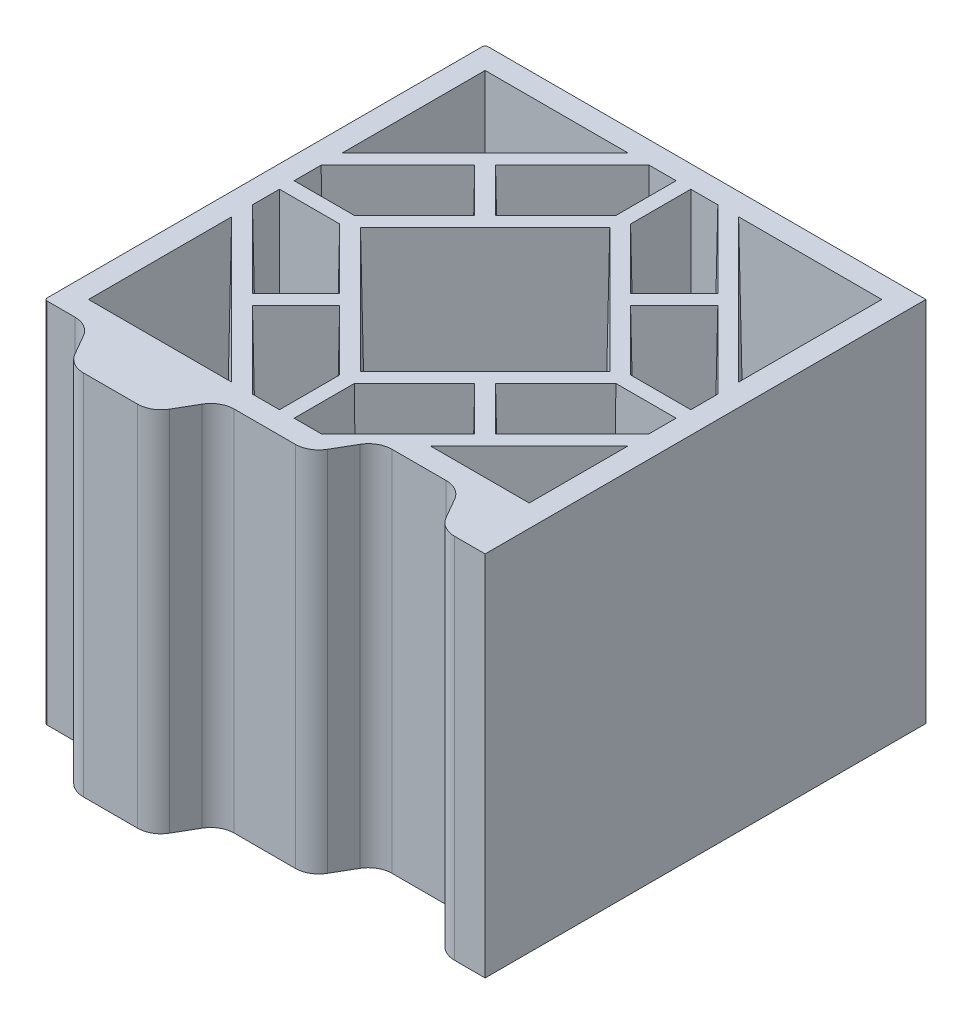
from build123d import *

# Parameters (mm, degrees)
EXTRUSION1_DEPTH = 25
D_POUILLE1_ANGLE = 1


with BuildPart() as part:
    # Esquisse1 → Extrusion1 (new body)
    with BuildSketch(Plane(origin=(0, 0, 0), x_dir=(1, 0, 0), z_dir=(0, 1, 0))):
        with BuildLine():
            Line((10.72401646, -2.202153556), (11.537707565, -0.797846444))
            ThreePointArc((11.537707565, -0.797846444), (12.123180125, -0.213737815), (12.922102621, 0))
            Line((12.922102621, 0), (17.077897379, 0))
            ThreePointArc((17.077897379, 0), (17.876819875, 0.213737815), (18.462292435, 0.797846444))
            Line((18.462292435, 0.797846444), (19.27598354, 2.202153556))
            ThreePointArc((19.27598354, 2.202153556), (19.8614561, 2.786262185), (20.660378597, 3))
            Line((20.660378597, 3), (24.344188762, 3))
            ThreePointArc((24.344188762, 3), (25.144188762, 2.785640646), (25.729829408, 2.2))
            Line((25.729829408, 2.2), (26.538119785, 0.8))
            ThreePointArc((26.538119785, 0.8), (27.123760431, 0.214359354), (27.923760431, 0))
            Line((27.923760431, 0), (30, 0))
            Line((30, 0), (30, 30))
            Line((30, 30), (0.2, 30))
            ThreePointArc((0.2, 30), (0.058578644, 29.941421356), (0, 29.8))
            Line((0, 29.8), (0, 0.2))
            ThreePointArc((0, 0.2), (0.058578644, 0.058578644), (0.2, 0))
            Line((0.2, 0), (2.076239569, 0))
            ThreePointArc((2.076239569, 0), (2.876239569, -0.214359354), (3.461880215, -0.8))
            Line((3.461880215, -0.8), (4.270170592, -2.2))
            ThreePointArc((4.270170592, -2.2), (4.855811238, -2.785640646), (5.655811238, -3))
            Line((5.655811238, -3), (9.339621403, -3))
            ThreePointArc((9.339621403, -3), (10.1385439, -2.786262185), (10.72401646, -2.202153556))
        make_face()
        Polygon((1.5, 1.5), (11.246016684, 1.5), (1.5, 11.246594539), align=None, mode=Mode.SUBTRACT)
        Polygon((1.5, 18.753405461), (1.5, 28.5), (11.246016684, 28.5), align=None, mode=Mode.SUBTRACT)
        Polygon((1.5, 15.5), (1.5, 17.339191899), (6.72685066, 22.566042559), (9.696699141, 19.596194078), (5.600505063, 15.5), align=None, mode=Mode.SUBTRACT)
        Polygon((7.433957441, 23.27314934), (10.403805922, 20.303300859), (14.5, 24.399494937), (14.5, 28.5), (12.660808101, 28.5), align=None, mode=Mode.SUBTRACT)
        Polygon((6.514718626, 15), (15, 23.485281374), (23.485281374, 15), (15, 6.514718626), align=None, mode=Mode.SUBTRACT)
        Polygon((23.27314934, 22.566042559), (20.303300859, 19.596194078), (24.399494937, 15.5), (28.5, 15.5), (28.5, 17.339191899), align=None, mode=Mode.SUBTRACT)
        Polygon((15.5, 24.399494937), (15.5, 28.5), (17.339191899, 28.5), (22.566042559, 23.27314934), (19.596194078, 20.303300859), align=None, mode=Mode.SUBTRACT)
        Polygon((28.5, 28.5), (18.753983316, 28.5), (28.5, 18.753405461), align=None, mode=Mode.SUBTRACT)
        Polygon((24.399494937, 14.5), (28.5, 14.5), (28.5, 12.660808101), (23.27314934, 7.433957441), (20.303300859, 10.403805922), align=None, mode=Mode.SUBTRACT)
        Polygon((22.566042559, 6.72685066), (19.596194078, 9.696699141), (15.5, 5.600505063), (15.5, 1.5), (17.339191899, 1.5), align=None, mode=Mode.SUBTRACT)
        Polygon((28.5, 11.246594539), (28.5, 4.5), (21.753805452, 4.5), align=None, mode=Mode.SUBTRACT)
        Polygon((10.403805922, 9.696699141), (14.5, 5.600505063), (14.5, 1.5), (12.660808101, 1.5), (7.433957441, 6.72685066), align=None, mode=Mode.SUBTRACT)
        Polygon((6.72685066, 7.433957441), (9.696699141, 10.403805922), (5.600505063, 14.5), (1.5, 14.5), (1.5, 12.660808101), align=None, mode=Mode.SUBTRACT)
    extrude(amount=EXTRUSION1_DEPTH)

    # D_pouille1
    d_pouille1_faces = [part.faces().sort_by_distance(p)[0] for p in [
        (6.373008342, 12.5, -1.5),
        (6.373008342, 12.5, -6.37329727),
        (1.5, 12.5, -6.37329727),
        (15.5, 12.5, -3.550252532),
        (25.126902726, 12.5, -7.87329727),
        (22.351397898, 12.5, -12.451902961),
        (21.788225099, 12.5, -21.081118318),
        (10.047382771, 12.5, -25.88657467),
        (25.126902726, 12.5, -4.5),
        (17.548097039, 12.5, -7.648602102),
        (10.757359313, 12.5, -19.242640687),
        (8.918881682, 12.5, -8.211774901),
        (3.550252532, 12.5, -14.5),
        (4.11342533, 12.5, -19.952617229),
        (26.449747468, 12.5, -14.5),
        (23.626991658, 12.5, -28.5),
        (15.5, 12.5, -26.449747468),
        (16.419595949, 12.5, -28.5),
        (13.580404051, 12.5, -28.5),
        (6.373008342, 12.5, -28.5),
        (12.451902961, 12.5, -7.648602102),
        (14.5, 12.5, -3.550252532),
        (28.5, 12.5, -7.87329727),
        (21.081118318, 12.5, -8.211774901),
        (28.5, 12.5, -13.580404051),
        (28.5, 12.5, -16.419595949),
        (25.88657467, 12.5, -19.952617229),
        (28.5, 12.5, -23.62670273),
        (19.952617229, 12.5, -25.88657467),
        (14.5, 12.5, -26.449747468),
        (19.242640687, 12.5, -19.242640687),
        (8.211774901, 12.5, -21.081118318),
        (7.648602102, 12.5, -12.451902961),
        (25.88657467, 12.5, -10.047382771),
        (21.788225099, 12.5, -8.918881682),
        (26.449747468, 12.5, -15.5),
        (22.351397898, 12.5, -17.548097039),
        (19.242640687, 12.5, -10.757359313),
        (10.757359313, 12.5, -10.757359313),
        (1.5, 12.5, -13.580404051),
        (7.648602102, 12.5, -17.548097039),
        (3.550252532, 12.5, -15.5),
        (1.5, 12.5, -16.419595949),
        (1.5, 12.5, -23.62670273),
        (6.373008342, 12.5, -23.62670273),
        (8.918881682, 12.5, -21.788225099),
        (12.451902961, 12.5, -22.351397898),
        (21.081118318, 12.5, -21.788225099),
        (17.548097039, 12.5, -22.351397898),
        (23.626991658, 12.5, -23.62670273),
        (10.047382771, 12.5, -4.11342533),
        (4.11342533, 12.5, -10.047382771),
        (8.211774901, 12.5, -8.918881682),
        (13.580404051, 12.5, -1.5),
        (16.419595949, 12.5, -1.5),
        (19.952617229, 12.5, -4.11342533),
    ]]
    draft(d_pouille1_faces, Plane(origin=(12.922102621, 25, 1.6), x_dir=(0, 0, 1), z_dir=(0, 1, 0)), D_POUILLE1_ANGLE)


solid = part.part
